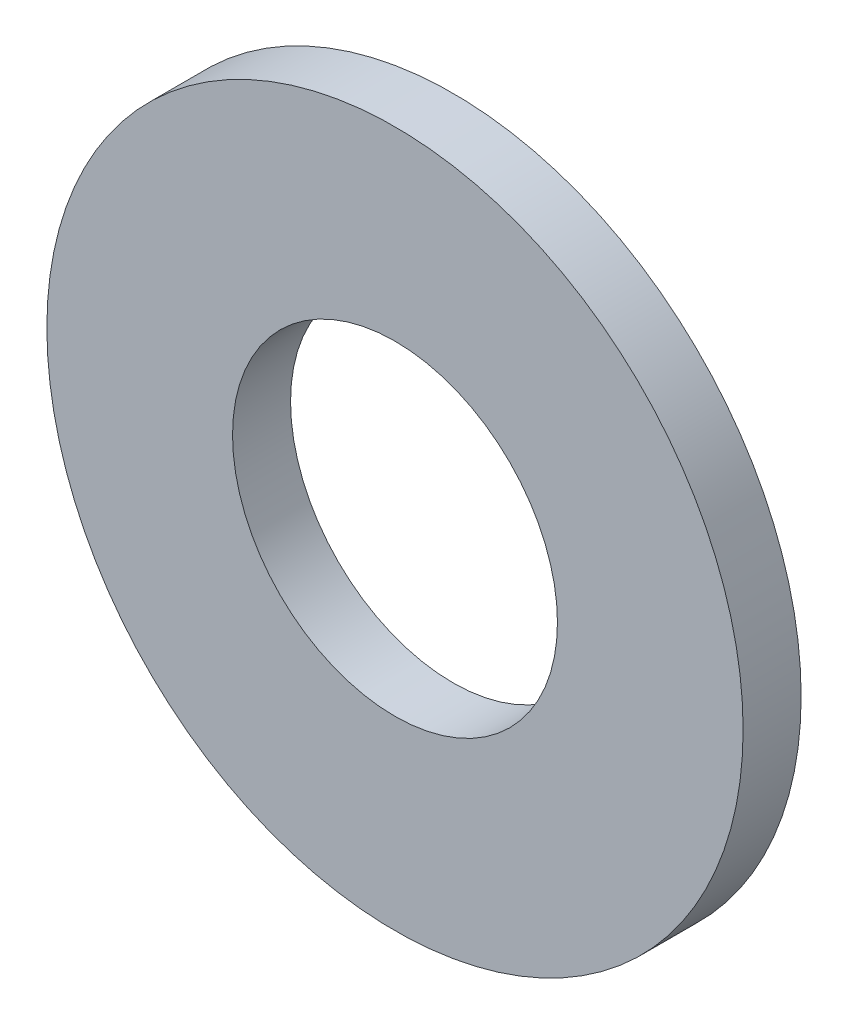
from build123d import *

# Parameters (mm, degrees)
E_CORPS_R              = 9
CORPS_DEPTH            = 1.5
E_PER_AGE_R            = 4.2
DIAM_TRE_NOMINAL_DEPTH = 13.816005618


with BuildPart() as part:
    # E_corps → Corps (new body)
    with BuildSketch(Plane.XY):
        with Locations(Location((0, 0, 0), (0, 0, 180))):
            Circle(E_CORPS_R)
    extrude(amount=CORPS_DEPTH)

    # E_per_age → Diam_tre_nominal (cut, through all)
    with BuildSketch(Plane(origin=(0, 0, 0), x_dir=(-1, 0, 0), z_dir=(0, 0, -1))):
        Circle(E_PER_AGE_R)
    extrude(amount=-DIAM_TRE_NOMINAL_DEPTH, mode=Mode.SUBTRACT)


solid = part.part
